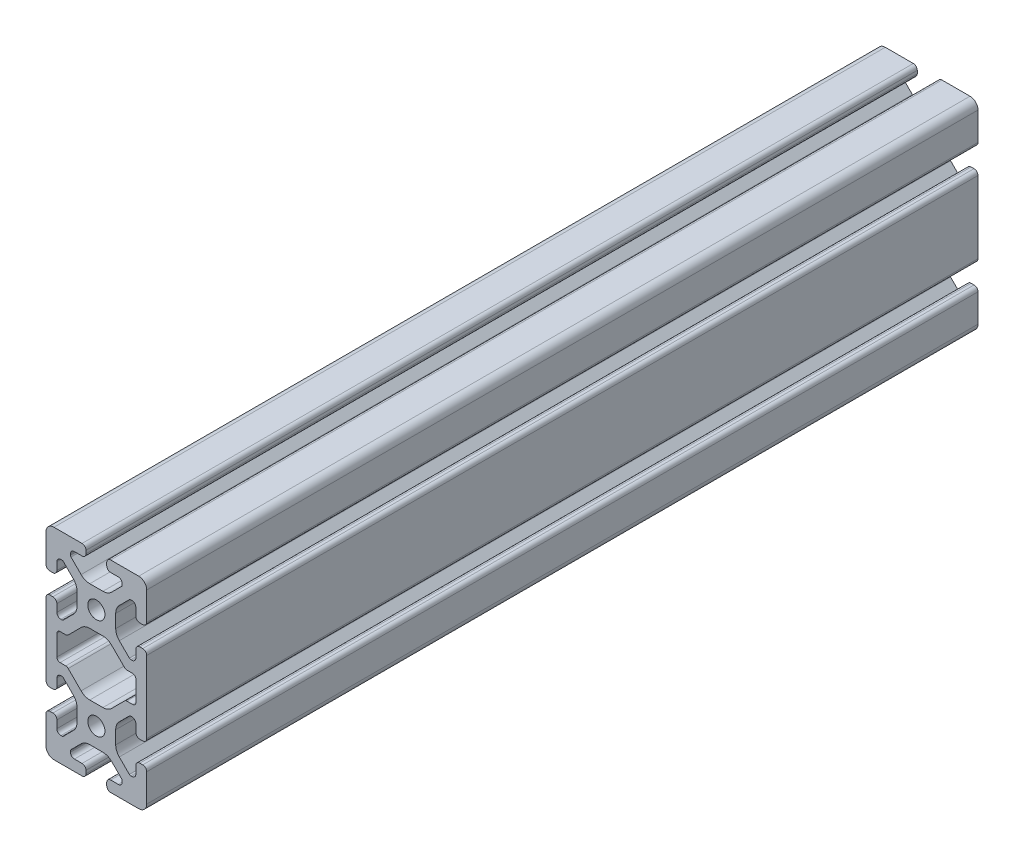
from build123d import *

# Parameters (mm, degrees)
SKETCH1_R           = 3.405
BOSS_EXTRUDE1_DEPTH = 3048
SKETCH26_W          = 40
SKETCH26_H          = 80.80011746
CUT_EXTRUDE1_DEPTH  = 2287.874723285
SKETCH33_W          = 40
SKETCH33_H          = 80.80011746
CUT_EXTRUDE2_DEPTH  = 1526.311771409
SKETCH41_W          = 40
SKETCH41_H          = 80.80011746
CUT_EXTRUDE3_DEPTH  = 1116.83781704
SKETCH50_W          = 40
SKETCH50_H          = 80.80011746
CUT_EXTRUDE4_DEPTH  = 787.391388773
SKETCH52_R          = 2.5
CUT_EXTRUDE5_DEPTH  = 2266.304039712


with BuildPart() as part:
    # Sketch1 → Boss-Extrude1 (new body)
    with BuildSketch(Plane(origin=(0, 0, -3048), x_dir=(-1, 0, 0), z_dir=(0, 0, -1))):
        with BuildLine():
            Line((16.83, 60), (5.69044933, 60))
            ThreePointArc((5.69044933, 60), (4.580291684, 59.540157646), (4.12044933, 58.43))
            Line((4.12044933, 58.43), (4.12044933, 57.25))
            ThreePointArc((4.12044933, 57.25), (4.580291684, 56.139842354), (5.69044933, 55.68))
            Line((5.69044933, 55.68), (8.7153995, 55.68))
            ThreePointArc((8.7153995, 55.68), (9.825557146, 55.220157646), (10.2853995, 54.11))
            Line((10.2853995, 54.11), (10.2853995, 53.654903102))
            ThreePointArc((10.2853995, 53.654903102), (10.227547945, 53.364063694), (10.062800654, 53.117501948))
            Line((10.062800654, 53.117501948), (6.055092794, 49.109794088))
            ThreePointArc((6.055092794, 49.109794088), (4.47691877, 48.055291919), (2.615335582, 47.685))
            Line((2.615335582, 47.685), (-2.615335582, 47.685))
            ThreePointArc((-2.615335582, 47.685), (-4.47691877, 48.055291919), (-6.055092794, 49.109794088))
            Line((-6.055092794, 49.109794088), (-10.062800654, 53.117501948))
            ThreePointArc((-10.062800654, 53.117501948), (-10.227547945, 53.364063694), (-10.2853995, 53.654903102))
            Line((-10.2853995, 53.654903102), (-10.2853995, 54.11))
            ThreePointArc((-10.2853995, 54.11), (-9.825557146, 55.220157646), (-8.7153995, 55.68))
            Line((-8.7153995, 55.68), (-5.69044933, 55.68))
            ThreePointArc((-5.69044933, 55.68), (-4.580291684, 56.139842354), (-4.12044933, 57.25))
            Line((-4.12044933, 57.25), (-4.12044933, 58.43))
            ThreePointArc((-4.12044933, 58.43), (-4.580291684, 59.540157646), (-5.69044933, 60))
            Line((-5.69044933, 60), (-16.83, 60))
            ThreePointArc((-16.83, 60), (-19.071528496, 59.071528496), (-20, 56.83))
            Line((-20, 56.83), (-20, 45.69044933))
            ThreePointArc((-20, 45.69044933), (-19.540157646, 44.580291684), (-18.43, 44.12044933))
            Line((-18.43, 44.12044933), (-17.25, 44.12044933))
            ThreePointArc((-17.25, 44.12044933), (-16.139842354, 44.580291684), (-15.68, 45.69044933))
            Line((-15.68, 45.69044933), (-15.68, 48.7153995))
            ThreePointArc((-15.68, 48.7153995), (-15.220157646, 49.825557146), (-14.11, 50.2853995))
            Line((-14.11, 50.2853995), (-13.652670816, 50.2853995))
            ThreePointArc((-13.652670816, 50.2853995), (-13.361831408, 50.227547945), (-13.115269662, 50.062800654))
            Line((-13.115269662, 50.062800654), (-9.109794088, 46.05732508))
            ThreePointArc((-9.109794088, 46.05732508), (-8.055291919, 44.479151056), (-7.685, 42.617567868))
            Line((-7.685, 42.617567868), (-7.685, 37.384664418))
            ThreePointArc((-7.685, 37.384664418), (-8.055291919, 35.52308123), (-9.109794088, 33.944907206))
            Line((-9.109794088, 33.944907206), (-13.117501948, 29.937199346))
            ThreePointArc((-13.117501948, 29.937199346), (-13.364063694, 29.772452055), (-13.654903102, 29.7146005))
            Line((-13.654903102, 29.7146005), (-14.11, 29.7146005))
            ThreePointArc((-14.11, 29.7146005), (-15.220157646, 30.174442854), (-15.68, 31.2846005))
            Line((-15.68, 31.2846005), (-15.68, 34.30955067))
            ThreePointArc((-15.68, 34.30955067), (-16.139842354, 35.419708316), (-17.25, 35.87955067))
            Line((-17.25, 35.87955067), (-18.43, 35.87955067))
            ThreePointArc((-18.43, 35.87955067), (-19.540157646, 35.419708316), (-20, 34.30955067))
            Line((-20, 34.30955067), (-20, 5.69044933))
            ThreePointArc((-20, 5.69044933), (-19.540157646, 4.580291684), (-18.43, 4.12044933))
            Line((-18.43, 4.12044933), (-17.25, 4.12044933))
            ThreePointArc((-17.25, 4.12044933), (-16.139842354, 4.580291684), (-15.68, 5.69044933))
            Line((-15.68, 5.69044933), (-15.68, 8.7153995))
            ThreePointArc((-15.68, 8.7153995), (-15.220157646, 9.825557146), (-14.11, 10.2853995))
            Line((-14.11, 10.2853995), (-13.654903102, 10.2853995))
            ThreePointArc((-13.654903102, 10.2853995), (-13.364063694, 10.227547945), (-13.117501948, 10.062800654))
            Line((-13.117501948, 10.062800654), (-9.109794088, 6.055092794))
            ThreePointArc((-9.109794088, 6.055092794), (-8.055291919, 4.47691877), (-7.685, 2.615335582))
            Line((-7.685, 2.615335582), (-7.685, -2.615335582))
            ThreePointArc((-7.685, -2.615335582), (-8.055291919, -4.47691877), (-9.109794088, -6.055092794))
            Line((-9.109794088, -6.055092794), (-13.117501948, -10.062800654))
            ThreePointArc((-13.117501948, -10.062800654), (-13.364063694, -10.227547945), (-13.654903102, -10.2853995))
            Line((-13.654903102, -10.2853995), (-14.11, -10.2853995))
            ThreePointArc((-14.11, -10.2853995), (-15.220157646, -9.825557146), (-15.68, -8.7153995))
            Line((-15.68, -8.7153995), (-15.68, -5.69044933))
            ThreePointArc((-15.68, -5.69044933), (-16.139842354, -4.580291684), (-17.25, -4.12044933))
            Line((-17.25, -4.12044933), (-18.43, -4.12044933))
            ThreePointArc((-18.43, -4.12044933), (-19.540157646, -4.580291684), (-20, -5.69044933))
            Line((-20, -5.69044933), (-20, -16.83))
            ThreePointArc((-20, -16.83), (-19.071528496, -19.071528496), (-16.83, -20))
            Line((-16.83, -20), (-5.69044933, -20))
            ThreePointArc((-5.69044933, -20), (-4.580291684, -19.540157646), (-4.12044933, -18.43))
            Line((-4.12044933, -18.43), (-4.12044933, -17.25))
            ThreePointArc((-4.12044933, -17.25), (-4.580291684, -16.139842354), (-5.69044933, -15.68))
            Line((-5.69044933, -15.68), (-8.7153995, -15.68))
            ThreePointArc((-8.7153995, -15.68), (-9.825557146, -15.220157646), (-10.2853995, -14.11))
            Line((-10.2853995, -14.11), (-10.2853995, -13.654903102))
            ThreePointArc((-10.2853995, -13.654903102), (-10.227547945, -13.364063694), (-10.062800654, -13.117501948))
            Line((-10.062800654, -13.117501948), (-6.055092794, -9.109794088))
            ThreePointArc((-6.055092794, -9.109794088), (-4.47691877, -8.055291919), (-2.615335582, -7.685))
            Line((-2.615335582, -7.685), (2.615335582, -7.685))
            ThreePointArc((2.615335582, -7.685), (4.47691877, -8.055291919), (6.055092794, -9.109794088))
            Line((6.055092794, -9.109794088), (10.062800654, -13.117501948))
            ThreePointArc((10.062800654, -13.117501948), (10.227547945, -13.364063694), (10.2853995, -13.654903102))
            Line((10.2853995, -13.654903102), (10.2853995, -14.11))
            ThreePointArc((10.2853995, -14.11), (9.825557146, -15.220157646), (8.7153995, -15.68))
            Line((8.7153995, -15.68), (5.69044933, -15.68))
            ThreePointArc((5.69044933, -15.68), (4.580291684, -16.139842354), (4.12044933, -17.25))
            Line((4.12044933, -17.25), (4.12044933, -18.43))
            ThreePointArc((4.12044933, -18.43), (4.580291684, -19.540157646), (5.69044933, -20))
            Line((5.69044933, -20), (16.83, -20))
            ThreePointArc((16.83, -20), (19.071528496, -19.071528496), (20, -16.83))
            Line((20, -16.83), (20, -5.69044933))
            ThreePointArc((20, -5.69044933), (19.540157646, -4.580291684), (18.43, -4.12044933))
            Line((18.43, -4.12044933), (17.25, -4.12044933))
            ThreePointArc((17.25, -4.12044933), (16.139842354, -4.580291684), (15.68, -5.69044933))
            Line((15.68, -5.69044933), (15.68, -8.7153995))
            ThreePointArc((15.68, -8.7153995), (15.220157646, -9.825557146), (14.11, -10.2853995))
            Line((14.11, -10.2853995), (13.654903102, -10.2853995))
            ThreePointArc((13.654903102, -10.2853995), (13.364063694, -10.227547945), (13.117501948, -10.062800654))
            Line((13.117501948, -10.062800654), (9.109794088, -6.055092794))
            ThreePointArc((9.109794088, -6.055092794), (8.055291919, -4.47691877), (7.685, -2.615335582))
            Line((7.685, -2.615335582), (7.685, 2.615335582))
            ThreePointArc((7.685, 2.615335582), (8.055291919, 4.47691877), (9.109794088, 6.055092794))
            Line((9.109794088, 6.055092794), (13.117501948, 10.062800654))
            ThreePointArc((13.117501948, 10.062800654), (13.364063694, 10.227547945), (13.654903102, 10.2853995))
            Line((13.654903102, 10.2853995), (14.11, 10.2853995))
            ThreePointArc((14.11, 10.2853995), (15.220157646, 9.825557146), (15.68, 8.7153995))
            Line((15.68, 8.7153995), (15.68, 5.69044933))
            ThreePointArc((15.68, 5.69044933), (16.139842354, 4.580291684), (17.25, 4.12044933))
            Line((17.25, 4.12044933), (18.43, 4.12044933))
            ThreePointArc((18.43, 4.12044933), (19.540157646, 4.580291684), (20, 5.69044933))
            Line((20, 5.69044933), (20, 34.30955067))
            ThreePointArc((20, 34.30955067), (19.540157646, 35.419708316), (18.43, 35.87955067))
            Line((18.43, 35.87955067), (17.25, 35.87955067))
            ThreePointArc((17.25, 35.87955067), (16.139842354, 35.419708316), (15.68, 34.30955067))
            Line((15.68, 34.30955067), (15.68, 31.2846005))
            ThreePointArc((15.68, 31.2846005), (15.220157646, 30.174442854), (14.11, 29.7146005))
            Line((14.11, 29.7146005), (13.654903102, 29.7146005))
            ThreePointArc((13.654903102, 29.7146005), (13.364063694, 29.772452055), (13.117501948, 29.937199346))
            Line((13.117501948, 29.937199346), (9.109794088, 33.944907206))
            ThreePointArc((9.109794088, 33.944907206), (8.055291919, 35.52308123), (7.685, 37.384664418))
            Line((7.685, 37.384664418), (7.685, 42.615335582))
            ThreePointArc((7.685, 42.615335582), (8.055291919, 44.47691877), (9.109794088, 46.055092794))
            Line((9.109794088, 46.055092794), (13.117501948, 50.062800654))
            ThreePointArc((13.117501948, 50.062800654), (13.364063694, 50.227547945), (13.654903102, 50.2853995))
            Line((13.654903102, 50.2853995), (14.11, 50.2853995))
            ThreePointArc((14.11, 50.2853995), (15.220157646, 49.825557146), (15.68, 48.7153995))
            Line((15.68, 48.7153995), (15.68, 45.69044933))
            ThreePointArc((15.68, 45.69044933), (16.139842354, 44.580291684), (17.25, 44.12044933))
            Line((17.25, 44.12044933), (18.43, 44.12044933))
            ThreePointArc((18.43, 44.12044933), (19.540157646, 44.580291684), (20, 45.69044933))
            Line((20, 45.69044933), (20, 56.83))
            ThreePointArc((20, 56.83), (19.071528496, 59.071528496), (16.83, 60))
        make_face()
        with Locations(Location((0, 0, 0), (0, 0, 180))):
            Circle(SKETCH1_R, mode=Mode.SUBTRACT)
        with Locations(Location((0, 40, 0), (0, 0, 180))):
            Circle(SKETCH1_R, mode=Mode.SUBTRACT)
        with BuildLine():
            Line((14.41, 14.65864833), (12.129998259, 14.65864833))
            ThreePointArc((12.129998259, 14.65864833), (11.608780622, 14.546764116), (11.179399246, 14.230824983))
            Line((11.179399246, 14.230824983), (6.055092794, 9.109794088))
            ThreePointArc((6.055092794, 9.109794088), (4.47691877, 8.055291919), (2.615335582, 7.685))
            Line((2.615335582, 7.685), (-2.615335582, 7.685))
            ThreePointArc((-2.615335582, 7.685), (-4.47691877, 8.055291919), (-6.055092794, 9.109794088))
            Line((-6.055092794, 9.109794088), (-11.231972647, 14.286673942))
            ThreePointArc((-11.231972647, 14.286673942), (-11.6439903, 14.561975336), (-12.129998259, 14.65864833))
            Line((-12.129998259, 14.65864833), (-14.41, 14.65864833))
            ThreePointArc((-14.41, 14.65864833), (-15.308025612, 15.030622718), (-15.68, 15.92864833))
            Line((-15.68, 15.92864833), (-15.68, 24.07135167))
            ThreePointArc((-15.68, 24.07135167), (-15.308025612, 24.969377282), (-14.41, 25.34135167))
            Line((-14.41, 25.34135167), (-12.129998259, 25.34135167))
            ThreePointArc((-12.129998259, 25.34135167), (-11.6439903, 25.438024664), (-11.231972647, 25.713326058))
            Line((-11.231972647, 25.713326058), (-6.055092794, 30.890205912))
            ThreePointArc((-6.055092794, 30.890205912), (-4.47691877, 31.944708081), (-2.615335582, 32.315))
            Line((-2.615335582, 32.315), (2.617567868, 32.315))
            ThreePointArc((2.617567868, 32.315), (4.479151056, 31.944708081), (6.05732508, 30.890205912))
            Line((6.05732508, 30.890205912), (11.184160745, 25.763370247))
            ThreePointArc((11.184160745, 25.763370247), (11.612140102, 25.451641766), (12.129998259, 25.34135167))
            Line((12.129998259, 25.34135167), (14.41, 25.34135167))
            ThreePointArc((14.41, 25.34135167), (15.308025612, 24.969377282), (15.68, 24.07135167))
            Line((15.68, 24.07135167), (15.68, 15.92864833))
            ThreePointArc((15.68, 15.92864833), (15.308025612, 15.030622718), (14.41, 14.65864833))
        make_face(mode=Mode.SUBTRACT)
    extrude(amount=-BOSS_EXTRUDE1_DEPTH)

    # Sketch26 → Cut-Extrude1 (cut, through all)
    with BuildSketch(Plane.XY.offset(-762)):
        with Locations((0, 19.59994127)):
            Rectangle(SKETCH26_W, SKETCH26_H)
    extrude(amount=CUT_EXTRUDE1_DEPTH, mode=Mode.SUBTRACT)

    # Sketch33 → Cut-Extrude2 (cut, through all)
    with BuildSketch(Plane.XY.offset(-1524)):
        with Locations((0, 19.59994127)):
            Rectangle(SKETCH33_W, SKETCH33_H)
    extrude(amount=CUT_EXTRUDE2_DEPTH, mode=Mode.SUBTRACT)

    # Sketch41 → Cut-Extrude3 (cut, through all)
    with BuildSketch(Plane.XY.offset(-1933.956)):
        with Locations((0, 19.59994127)):
            Rectangle(SKETCH41_W, SKETCH41_H)
    extrude(amount=CUT_EXTRUDE3_DEPTH, mode=Mode.SUBTRACT)

    # Sketch50 → Cut-Extrude4 (cut, through all)
    with BuildSketch(Plane.XY.offset(-2264.156)):
        with Locations((0, 19.59994127)):
            Rectangle(SKETCH50_W, SKETCH50_H)
    extrude(amount=-CUT_EXTRUDE4_DEPTH, mode=Mode.SUBTRACT)

    # Sketch52 → Cut-Extrude5 (cut, through all)
    with BuildSketch(Plane.ZY.offset(20)):
        with Locations(Location((-1972.455999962, 38.650000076, 0), (0, 0, 210.406676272))):
            Circle(SKETCH52_R)
        with Locations(Location((-2009.756000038, 38.650000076, 0), (0, 0, 210.406676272))):
            Circle(SKETCH52_R)
        with Locations(Location((-2009.756000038, 1.35, 0), (0, 0, 30.406674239))):
            Circle(SKETCH52_R)
        with Locations(Location((-1972.455999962, 1.35, 0), (0, 0, 30.406674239))):
            Circle(SKETCH52_R)
        with Locations(Location((-2188.111999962, 1.35, 0), (0, 0, 30.406674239))):
            Circle(SKETCH52_R)
        with Locations(Location((-2225.412000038, 1.35, 0), (0, 0, 30.406674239))):
            Circle(SKETCH52_R)
        with Locations(Location((-2225.412000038, 38.650000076, 0), (0, 0, 210.406676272))):
            Circle(SKETCH52_R)
        with Locations(Location((-2188.111999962, 38.650000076, 0), (0, 0, 210.406676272))):
            Circle(SKETCH52_R)
    extrude(amount=-CUT_EXTRUDE5_DEPTH, mode=Mode.SUBTRACT)


solid = part.part
